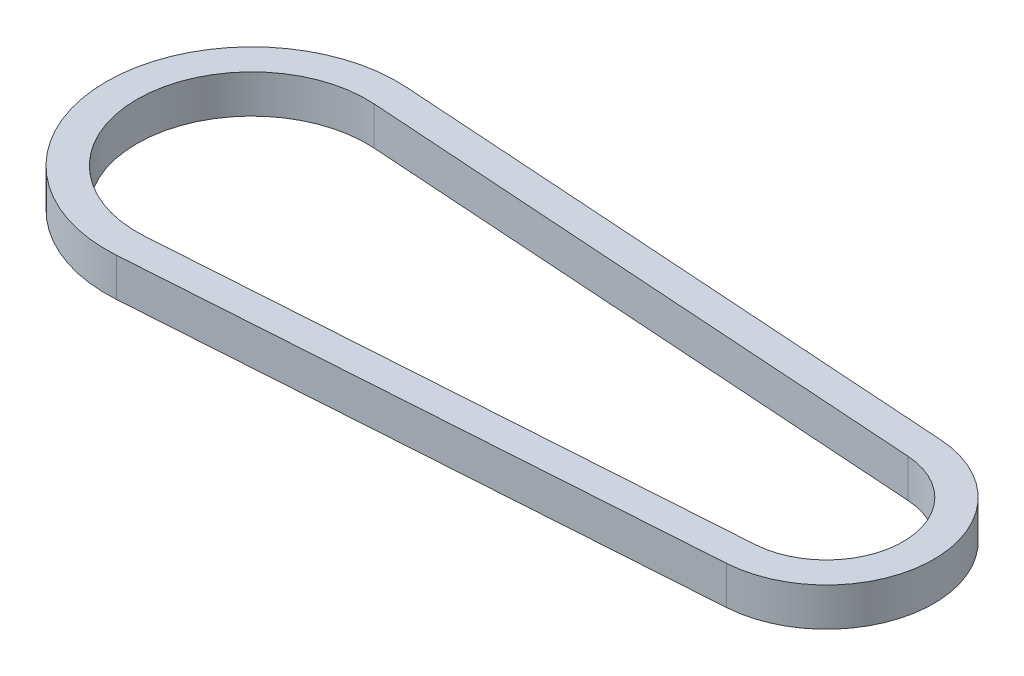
from build123d import *

# Parameters (mm, degrees)
BOSS_EXTRUDE1_DEPTH = 10


with BuildPart() as part:
    # Sketch1 → Boss-Extrude1 (new body)
    with BuildSketch(Plane(origin=(0, 0, 0), x_dir=(1, 0, 0), z_dir=(0, 1, 0))):
        with BuildLine():
            Line((2.533333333, 37.915461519), (151.866666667, 27.937708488))
            ThreePointArc((151.866666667, 27.937708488), (178, 0), (151.866666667, -27.937708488))
            Line((151.866666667, -27.937708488), (2.533333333, -37.915461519))
            ThreePointArc((2.533333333, -37.915461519), (-38, 0), (2.533333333, 37.915461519))
        make_face()
        with BuildLine():
            Line((2, 29.933259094), (151.333333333, 19.955506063))
            ThreePointArc((151.333333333, 19.955506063), (170, 0), (151.333333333, -19.955506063))
            Line((151.333333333, -19.955506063), (2, -29.933259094))
            ThreePointArc((2, -29.933259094), (-30, 0), (2, 29.933259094))
        make_face(mode=Mode.SUBTRACT)
    extrude(amount=BOSS_EXTRUDE1_DEPTH)


solid = part.part
